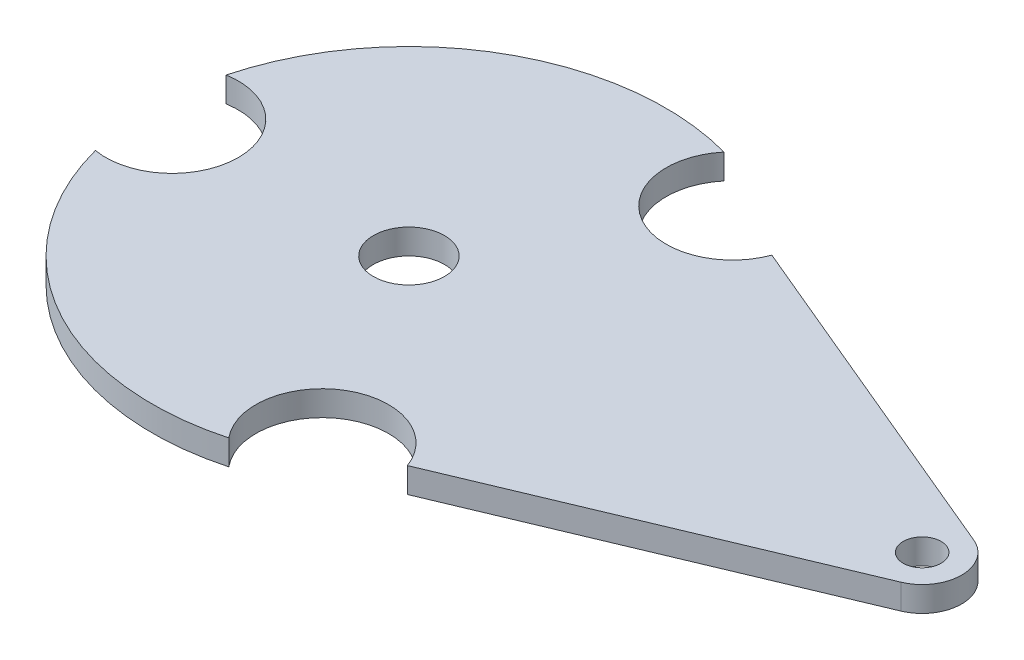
from build123d import *

# Parameters (mm, degrees)
BOSS_EXTRUDE1_DEPTH  = 0.79375
M4_CLEARANCE_HOLE1_D = 4.5
M2_CLEARANCE_HOLE1_D = 2.4


with BuildPart() as part:
    # Sketch3 → Boss-Extrude1 (new, symmetric)
    with BuildSketch(Plane(origin=(0, 0, 0), x_dir=(1, 0, 0), z_dir=(0, 1, 0))):
        with BuildLine():
            Line((11.441391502, -11.539370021), (33.4665866, -2.305582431))
            ThreePointArc((33.4665866, -2.305582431), (35, 0), (33.4665866, 2.305582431))
            Line((33.4665866, 2.305582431), (11.441391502, 11.539370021))
            ThreePointArc((11.441391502, 11.539370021), (5.4, 9.353074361), (4.272691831, 15.678220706))
            ThreePointArc((4.272691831, 15.678220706), (-8.125, 14.072912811), (-15.714083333, 4.138850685))
            ThreePointArc((-15.714083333, 4.138850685), (-10.8, 0), (-15.714083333, -4.138850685))
            ThreePointArc((-15.714083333, -4.138850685), (-8.125, -14.072912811), (4.272691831, -15.678220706))
            ThreePointArc((4.272691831, -15.678220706), (5.4, -9.353074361), (11.441391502, -11.539370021))
        make_face()
    extrude(amount=BOSS_EXTRUDE1_DEPTH, both=True)

    # M4 Clearance Hole1 (through all)
    with Locations(Plane(origin=(0, 0.79375, 0), x_dir=(1, 0, 0), z_dir=(0, 1, 0))):
        with Locations((0, 0)):
            Hole(M4_CLEARANCE_HOLE1_D / 2)

    # M2 Clearance Hole1 (through all)
    with Locations(Plane(origin=(0, 0.79375, 0), x_dir=(1, 0, 0), z_dir=(0, 1, 0))):
        with Locations((32.5, 0)):
            Hole(M2_CLEARANCE_HOLE1_D / 2)


solid = part.part
